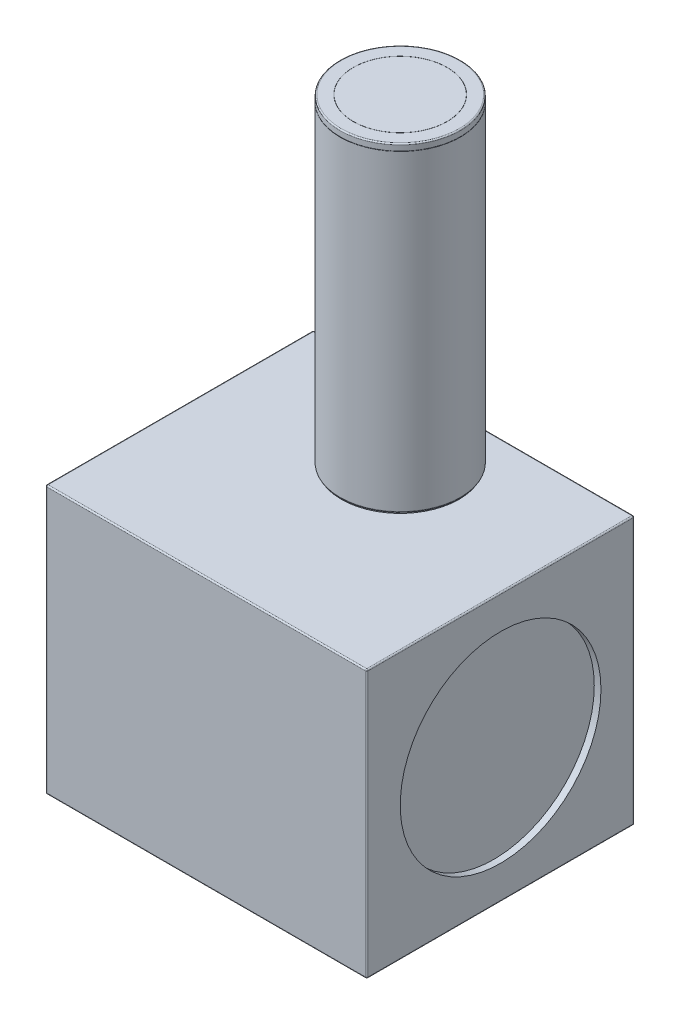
from build123d import *

# Parameters (mm, degrees)
SKETCH1_W           = 24
SKETCH1_H           = 20
BOSS_EXTRUDE1_DEPTH = 20
SKETCH2_R           = 7.5
CUT_EXTRUDE1_DEPTH  = 0.5
CUT_EXTRUDE2_START  = -0.5
SKETCH3_R           = 7.5
CUT_EXTRUDE2_DEPTH  = 0.5
CUT_EXTRUDE3_DEPTH  = 4
FILLET1_R           = 0.1


with BuildPart() as part:
    # Sketch1 → Boss-Extrude1 (new body)
    with BuildSketch(Plane.XY):
        Rectangle(SKETCH1_W, SKETCH1_H)
    extrude(amount=BOSS_EXTRUDE1_DEPTH)

    # Sketch2 → Cut-Extrude1 (cut)
    with BuildSketch(Plane(origin=(12, 0, 0), x_dir=(0, 0, -1), z_dir=(1, 0, 0))):
        with Locations((-10, 0)):
            Circle(SKETCH2_R)
    extrude(amount=-CUT_EXTRUDE1_DEPTH, mode=Mode.SUBTRACT)

    # Sketch3 → Cut-Extrude2 (cut)
    with BuildSketch(Plane.ZY.offset(12).offset(CUT_EXTRUDE2_START)):
        with Locations(Location((10, 0, 0), (0, 0, 180))):
            Circle(SKETCH3_R)
    extrude(amount=CUT_EXTRUDE2_DEPTH, mode=Mode.SUBTRACT)

    # Sketch4 → Revolve1 (revolve)
    with BuildSketch(Plane(origin=(0, 0, 0), x_dir=(0, 0, -1), z_dir=(1, 0, 0))):
        with BuildLine():
            Line((-5.5, -16), (-9.91, -16))
            ThreePointArc((-9.91, -16), (-9.97363961, -15.97363961), (-10, -15.91))
            Line((-10, -15.91), (-10, -10.19))
            ThreePointArc((-10, -10.19), (-9.97363961, -10.12636039), (-9.91, -10.1))
            Line((-9.91, -10.1), (-9.9, -10.1))
            Line((-9.9, -10.1), (-9.9, -10))
            Line((-9.9, -10), (-9.9, 10))
            Line((-9.9, 10), (-9.9, 10.1))
            Line((-9.9, 10.1), (-9.91, 10.1))
            ThreePointArc((-9.91, 10.1), (-9.97363961, 10.12636039), (-10, 10.19))
            Line((-10, 10.19), (-10, 33.491))
            ThreePointArc((-10, 33.491), (-9.997363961, 33.497363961), (-9.991, 33.5))
            Line((-9.991, 33.5), (-9.99, 33.5))
            Line((-9.99, 33.5), (-9.991, 33.51))
            ThreePointArc((-9.991, 33.51), (-9.997363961, 33.512636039), (-10, 33.519))
            Line((-10, 33.519), (-10, 33.91))
            ThreePointArc((-10, 33.91), (-9.97363961, 33.97363961), (-9.91, 34))
            Line((-9.91, 34), (-9.01, 34))
            Line((-9.01, 34), (-9.01, 33.9))
            Line((-9.01, 33.9), (-9, 33.9))
            Line((-9, 33.9), (-9, 34))
            Line((-9, 34), (-5.5, 34))
            Line((-5.5, 34), (-5.5, -16))
        make_face()
    revolve(axis=Axis((0, 34, 5.5), (0, -1, 0)))

    # Sketch5 → Cut-Extrude3 (cut)
    with BuildSketch(Plane.XZ.offset(16)):
        Polygon((0, 8.098076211), (-2.25, 6.799038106), (-2.25, 4.200961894), (0, 2.901923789), (2.25, 4.200961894), (2.25, 6.799038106), align=None)
    extrude(amount=-CUT_EXTRUDE3_DEPTH, mode=Mode.SUBTRACT)

    # Fillet1
    fillet1_edges = [part.edges().sort_by_distance(p)[0] for p in [
        (12, 0, 20),
        (0, 10, 20),
        (-12, 0, 20),
        (0, 10, 0),
        (12, 0, 0),
        (0, -10, 0),
        (-12, 0, 0),
        (0, -10, 20),
        (-12, 10, 10),
        (12, 10, 10),
        (12, -10, 10),
        (-12, -10, 10),
    ]]
    fillet(fillet1_edges, radius=FILLET1_R)


solid = part.part
